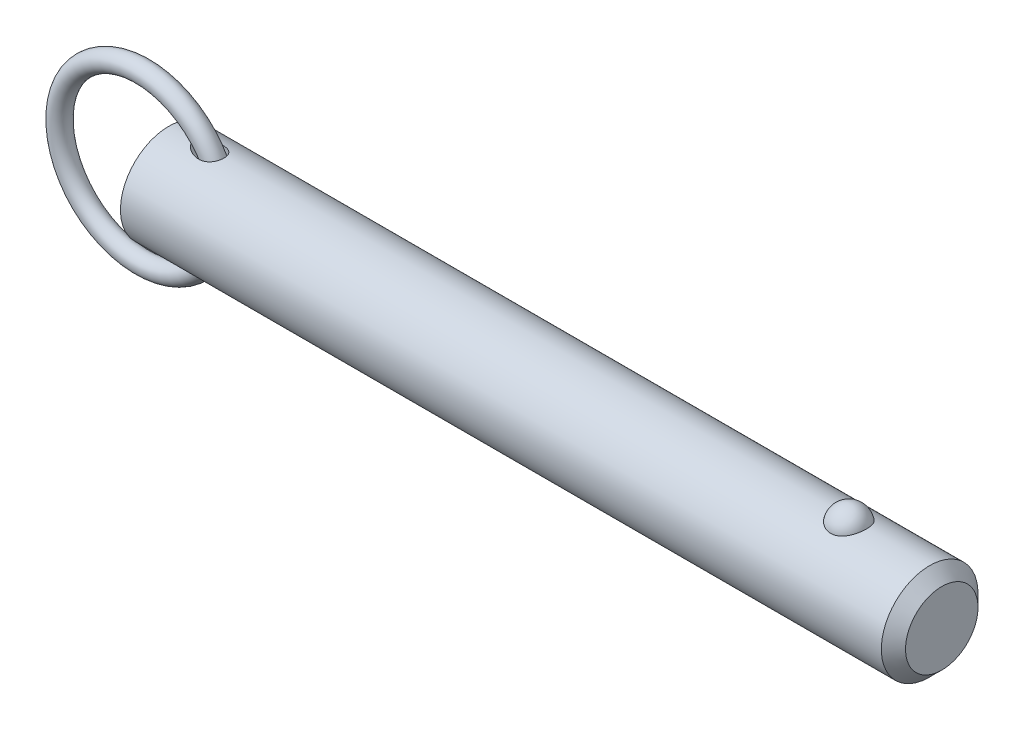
ISO-10303-21;
HEADER;
FILE_DESCRIPTION(('STEP AP214'),'2;1');
FILE_NAME('part.step','',(''),(''),'','','');
FILE_SCHEMA(('AUTOMOTIVE_DESIGN { 1 0 10303 214 1 1 1 1 }'));
ENDSEC;
DATA;
#1=APPLICATION_CONTEXT('core data for automotive mechanical design processes');
#2=APPLICATION_PROTOCOL_DEFINITION('international standard','automotive_design',2000,#1);
#3=PRODUCT_CONTEXT('',#1,'mechanical');
#4=PRODUCT('Part','Part','',(#3));
#5=PRODUCT_RELATED_PRODUCT_CATEGORY('part','',(#4));
#6=PRODUCT_DEFINITION_FORMATION('','',#4);
#7=PRODUCT_DEFINITION_CONTEXT('part definition',#1,'design');
#8=PRODUCT_DEFINITION('design','',#6,#7);
#9=PRODUCT_DEFINITION_SHAPE('','',#8);
#10=(LENGTH_UNIT() NAMED_UNIT(*) SI_UNIT(.MILLI.,.METRE.));
#11=(NAMED_UNIT(*) PLANE_ANGLE_UNIT() SI_UNIT($,.RADIAN.));
#12=(NAMED_UNIT(*) SI_UNIT($,.STERADIAN.) SOLID_ANGLE_UNIT());
#13=UNCERTAINTY_MEASURE_WITH_UNIT(LENGTH_MEASURE(1.E-05),#10,'distance_accuracy_value','');
#14=(GEOMETRIC_REPRESENTATION_CONTEXT(3) GLOBAL_UNCERTAINTY_ASSIGNED_CONTEXT((#13)) GLOBAL_UNIT_ASSIGNED_CONTEXT((#10,
#11,#12)) REPRESENTATION_CONTEXT('',''));
#15=CARTESIAN_POINT('',(0.,0.,0.));
#16=DIRECTION('',(0.,0.,1.));
#17=DIRECTION('',(1.,0.,0.));
#18=AXIS2_PLACEMENT_3D('',#15,#16,#17);
#19=CARTESIAN_POINT('',(-6.08699288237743,0.,0.));
#20=DIRECTION('',(0.,0.,1.));
#21=DIRECTION('',(1.,0.,0.));
#22=AXIS2_PLACEMENT_3D('',#19,#20,#21);
#23=TOROIDAL_SURFACE('',#22,19.05,2.223);
#24=CARTESIAN_POINT('',(15.1860071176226,0.,0.));
#25=VERTEX_POINT('',#24);
#26=VERTEX_LOOP('',#25);
#27=FACE_BOUND('',#26,.T.);
#28=ADVANCED_FACE('P0_F12',(#27),#23,.T.);
#29=CLOSED_SHELL('',(#28));
#30=MANIFOLD_SOLID_BREP('P0_B1',#29);
#31=CARTESIAN_POINT('',(0.,0.,0.));
#32=DIRECTION('',(1.,0.,0.));
#33=DIRECTION('',(0.,0.,-1.));
#34=AXIS2_PLACEMENT_3D('',#31,#32,#33);
#35=CYLINDRICAL_SURFACE('',#34,11.115);
#36=CARTESIAN_POINT('',(6.41405181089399,11.0227946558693,-1.4287136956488));
#37=CARTESIAN_POINT('',(6.49338916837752,11.0115377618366,-1.51556642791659));
#38=CARTESIAN_POINT('',(6.57765461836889,10.9998263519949,-1.59789397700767));
#39=CARTESIAN_POINT('',(6.75386647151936,10.9760304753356,-1.75391400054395));
#40=CARTESIAN_POINT('',(6.84582247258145,10.9639455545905,-1.82759540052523));
#41=CARTESIAN_POINT('',(7.03627827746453,10.9397989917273,-1.96698954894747));
#42=CARTESIAN_POINT('',(7.1348083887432,10.9277377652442,-2.03266078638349));
#43=CARTESIAN_POINT('',(7.33681032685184,10.9041015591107,-2.1558582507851));
#44=CARTESIAN_POINT('',(7.44028007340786,10.8925263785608,-2.21338786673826));
#45=CARTESIAN_POINT('',(7.64386117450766,10.8710104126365,-2.31666528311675));
#46=CARTESIAN_POINT('',(7.74368989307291,10.8610119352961,-2.36295942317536));
#47=CARTESIAN_POINT('',(7.94637195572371,10.8420168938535,-2.44863486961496));
#48=CARTESIAN_POINT('',(8.0492261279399,10.8330206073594,-2.48801426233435));
#49=CARTESIAN_POINT('',(8.36115573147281,10.807980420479,-2.59542730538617));
#50=CARTESIAN_POINT('',(8.57411849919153,10.7938278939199,-2.65299817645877));
#51=CARTESIAN_POINT('',(9.00825016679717,10.7725818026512,-2.73800108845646));
#52=CARTESIAN_POINT('',(9.22947335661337,10.7655491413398,-2.76517330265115));
#53=CARTESIAN_POINT('',(9.6736814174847,10.7605872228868,-2.78445308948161));
#54=CARTESIAN_POINT('',(9.89666486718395,10.7626512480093,-2.77658653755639));
#55=CARTESIAN_POINT('',(10.2950172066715,10.7754452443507,-2.72644436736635));
#56=CARTESIAN_POINT('',(10.4712789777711,10.7844280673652,-2.69109376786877));
#57=CARTESIAN_POINT('',(10.7292776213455,10.8024982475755,-2.61722365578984));
#58=CARTESIAN_POINT('',(10.8142337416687,10.8092901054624,-2.58911576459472));
#59=CARTESIAN_POINT('',(10.9813218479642,10.8242580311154,-2.52581287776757));
#60=CARTESIAN_POINT('',(11.0634550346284,10.8324335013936,-2.49062094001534));
#61=CARTESIAN_POINT('',(11.2247418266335,10.8500287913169,-2.41281958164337));
#62=CARTESIAN_POINT('',(11.3038694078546,10.8594572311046,-2.37015806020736));
#63=CARTESIAN_POINT('',(11.4576781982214,10.8792243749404,-2.27770403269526));
#64=CARTESIAN_POINT('',(11.5323615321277,10.8895626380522,-2.22791497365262));
#65=CARTESIAN_POINT('',(11.6765388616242,10.9108113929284,-2.12140590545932));
#66=CARTESIAN_POINT('',(11.7460329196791,10.9217218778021,-2.064685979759));
#67=CARTESIAN_POINT('',(11.8790597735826,10.9437207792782,-1.94471764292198));
#68=CARTESIAN_POINT('',(11.9425932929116,10.9548091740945,-1.88147002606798));
#69=CARTESIAN_POINT('',(12.109388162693,10.9851999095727,-1.69784918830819));
#70=CARTESIAN_POINT('',(12.205655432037,11.0042655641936,-1.57093023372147));
#71=CARTESIAN_POINT('',(12.374151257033,11.0393391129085,-1.3017676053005));
#72=CARTESIAN_POINT('',(12.4463875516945,11.0553479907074,-1.15952888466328));
#73=CARTESIAN_POINT('',(12.5615818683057,11.0816338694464,-0.871972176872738));
#74=CARTESIAN_POINT('',(12.6058896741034,11.0921698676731,-0.727217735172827));
#75=CARTESIAN_POINT('',(12.6699315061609,11.1075802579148,-0.43208997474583));
#76=CARTESIAN_POINT('',(12.6896681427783,11.1124552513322,-0.281717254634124));
#77=CARTESIAN_POINT('',(12.704022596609,11.1159901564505,0.0188164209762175));
#78=CARTESIAN_POINT('',(12.6988836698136,11.1147102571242,0.16896512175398));
#79=CARTESIAN_POINT('',(12.6641681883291,11.1062126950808,0.466238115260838));
#80=CARTESIAN_POINT('',(12.6345920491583,11.0989951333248,0.613362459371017));
#81=CARTESIAN_POINT('',(12.5517453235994,11.0794095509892,0.900330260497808));
#82=CARTESIAN_POINT('',(12.4984878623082,11.0670443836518,1.04017770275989));
#83=CARTESIAN_POINT('',(12.3696588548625,11.0385082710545,1.308745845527));
#84=CARTESIAN_POINT('',(12.2940887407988,11.0223375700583,1.43746725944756));
#85=CARTESIAN_POINT('',(12.122380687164,10.987872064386,1.68079704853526));
#86=CARTESIAN_POINT('',(12.0261637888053,10.969569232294,1.79534850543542));
#87=CARTESIAN_POINT('',(11.8161707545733,10.932836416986,2.00695695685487));
#88=CARTESIAN_POINT('',(11.7023941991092,10.9144064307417,2.10401353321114));
#89=CARTESIAN_POINT('',(11.4575656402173,10.8788057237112,2.28105326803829));
#90=CARTESIAN_POINT('',(11.3261451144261,10.8616794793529,2.36053412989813));
#91=CARTESIAN_POINT('',(11.0523589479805,10.8308019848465,2.49839044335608));
#92=CARTESIAN_POINT('',(10.9099908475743,10.8170514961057,2.55676113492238));
#93=CARTESIAN_POINT('',(10.6060622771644,10.7929728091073,2.65666105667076));
#94=CARTESIAN_POINT('',(10.4438877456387,10.7830209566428,2.69640163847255));
#95=CARTESIAN_POINT('',(10.1154037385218,10.7687230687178,2.75293129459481));
#96=CARTESIAN_POINT('',(9.94909141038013,10.7643810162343,2.76970406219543));
#97=CARTESIAN_POINT('',(9.54387061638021,10.7604809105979,2.7848723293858));
#98=CARTESIAN_POINT('',(9.30446860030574,10.7637793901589,2.7722775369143));
#99=CARTESIAN_POINT('',(8.94961255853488,10.7757341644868,2.72524141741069));
#100=CARTESIAN_POINT('',(8.83186896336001,10.7808994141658,2.70482239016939));
#101=CARTESIAN_POINT('',(8.59835142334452,10.7932548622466,2.65509992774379));
#102=CARTESIAN_POINT('',(8.48257728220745,10.8004448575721,2.62579738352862));
#103=CARTESIAN_POINT('',(8.25208469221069,10.8166382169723,2.55827624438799));
#104=CARTESIAN_POINT('',(8.13740214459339,10.8256649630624,2.51994155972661));
#105=CARTESIAN_POINT('',(7.91132058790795,10.8451170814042,2.43486475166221));
#106=CARTESIAN_POINT('',(7.79992154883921,10.8555424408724,2.38812270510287));
#107=CARTESIAN_POINT('',(7.58115677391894,10.8774251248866,2.28638483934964));
#108=CARTESIAN_POINT('',(7.47378802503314,10.8888816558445,2.23139534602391));
#109=CARTESIAN_POINT('',(7.26385624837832,10.9124540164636,2.11310265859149));
#110=CARTESIAN_POINT('',(7.16129168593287,10.9245696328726,2.04980214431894));
#111=CARTESIAN_POINT('',(6.91882218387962,10.9543689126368,1.88540538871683));
#112=CARTESIAN_POINT('',(6.7819377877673,10.9721958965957,1.77979827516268));
#113=CARTESIAN_POINT('',(6.52472441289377,11.0070222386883,1.5498969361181));
#114=CARTESIAN_POINT('',(6.40436902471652,11.0240228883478,1.42563320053));
#115=CARTESIAN_POINT('',(6.2183880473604,11.0509658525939,1.19529359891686));
#116=CARTESIAN_POINT('',(6.14691885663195,11.0615430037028,1.09404520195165));
#117=CARTESIAN_POINT('',(6.02043496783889,11.0805004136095,0.881508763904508));
#118=CARTESIAN_POINT('',(5.96539400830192,11.0888841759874,0.7702371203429));
#119=CARTESIAN_POINT('',(5.88475453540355,11.1012553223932,0.560577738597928));
#120=CARTESIAN_POINT('',(5.85559643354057,11.1057686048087,0.463603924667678));
#121=CARTESIAN_POINT('',(5.81381299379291,11.1122523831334,0.266083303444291));
#122=CARTESIAN_POINT('',(5.80117118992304,11.1142254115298,0.165540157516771));
#123=CARTESIAN_POINT('',(5.79363815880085,11.1153999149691,-0.0364747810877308));
#124=CARTESIAN_POINT('',(5.79878799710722,11.1145949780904,-0.137948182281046));
#125=CARTESIAN_POINT('',(5.82639592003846,11.1102987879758,-0.338493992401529));
#126=CARTESIAN_POINT('',(5.8488723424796,11.1068046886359,-0.437563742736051));
#127=CARTESIAN_POINT('',(5.91510741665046,11.0965857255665,-0.649968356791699));
#128=CARTESIAN_POINT('',(5.96220905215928,11.0893566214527,-0.762222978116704));
#129=CARTESIAN_POINT('',(6.07378449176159,11.072471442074,-0.977396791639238));
#130=CARTESIAN_POINT('',(6.13826787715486,11.0628140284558,-1.08031079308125));
#131=CARTESIAN_POINT('',(6.24101077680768,11.0477136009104,-1.2219580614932));
#132=CARTESIAN_POINT('',(6.27403486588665,11.042895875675,-1.26469183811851));
#133=CARTESIAN_POINT('',(6.3423802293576,11.0330152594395,-1.34817011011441));
#134=CARTESIAN_POINT('',(6.37769867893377,11.0279526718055,-1.38891694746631));
#135=CARTESIAN_POINT('',(6.41405181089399,11.0227946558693,-1.4287136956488));
#136=B_SPLINE_CURVE_WITH_KNOTS('',3,(#36,#37,#38,#39,#40,#41,#42,#43,#44,#45,#46,#47,#48,#49,
#50,#51,#52,#53,#54,#55,#56,#57,#58,#59,#60,#61,#62,#63,#64,#65,#66,#67,#68,#69,#70,#71,#72,#73,
#74,#75,#76,#77,#78,#79,#80,#81,#82,#83,#84,#85,#86,#87,#88,#89,#90,#91,#92,#93,#94,#95,#96,#97,
#98,#99,#100,#101,#102,#103,#104,#105,#106,#107,#108,#109,#110,#111,#112,#113,#114,#115,#116,
#117,#118,#119,#120,#121,#122,#123,#124,#125,#126,#127,#128,#129,#130,#131,#132,#133,#134,#135),
.UNSPECIFIED.,.T.,.F.,(4,2,2,2,2,2,2,2,2,2,2,2,2,2,2,2,2,2,2,2,2,2,2,2,2,2,2,2,2,2,2,2,2,2,2,2,
2,2,2,2,2,2,2,2,2,2,2,2,2,4),(0.,0.354433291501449,0.709315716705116,1.0659654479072,
1.42246628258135,1.7536715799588,2.08496839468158,2.74582009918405,3.41227815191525,
4.07824412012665,4.61583787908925,4.88478112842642,5.1536085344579,5.42439170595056,
5.69504436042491,5.96569375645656,6.23631025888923,6.7149072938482,7.1933500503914,
7.6464143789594,8.09943057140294,8.54802575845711,8.99661331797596,9.44495256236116,
9.89326303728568,10.3433195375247,10.7933867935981,11.2550086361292,11.7167345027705,
12.2165866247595,12.7167934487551,13.4318876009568,13.7904664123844,14.1490092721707,
14.5124394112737,14.8758662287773,15.239015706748,15.6020483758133,16.1219860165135,
16.6410830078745,17.0130520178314,17.3844231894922,17.6872330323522,17.9897407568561,
18.2929471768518,18.5964749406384,18.9603532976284,19.3244326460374,19.4870338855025,
19.649438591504),.UNSPECIFIED.);
#137=CARTESIAN_POINT('',(6.41405181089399,11.0227946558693,-1.4287136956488));
#138=VERTEX_POINT('',#137);
#139=EDGE_CURVE('P1_E40',#138,#138,#136,.T.);
#140=ORIENTED_EDGE('',*,*,#139,.T.);
#141=EDGE_LOOP('',(#140));
#142=FACE_BOUND('',#141,.T.);
#143=CARTESIAN_POINT('',(175.02125,0.,0.));
#144=DIRECTION('',(1.,0.,0.));
#145=DIRECTION('',(0.,0.,-1.));
#146=AXIS2_PLACEMENT_3D('',#143,#144,#145);
#147=CIRCLE('',#146,11.115);
#148=CARTESIAN_POINT('',(175.02125,0.,-11.115));
#149=VERTEX_POINT('',#148);
#150=EDGE_CURVE('P1_E25',#149,#149,#147,.T.);
#151=ORIENTED_EDGE('',*,*,#150,.F.);
#152=EDGE_LOOP('',(#151));
#153=FACE_BOUND('',#152,.T.);
#154=CARTESIAN_POINT('',(0.,0.,0.));
#155=DIRECTION('',(1.,0.,0.));
#156=DIRECTION('',(0.,0.,-1.));
#157=AXIS2_PLACEMENT_3D('',#154,#155,#156);
#158=CIRCLE('',#157,11.115);
#159=CARTESIAN_POINT('',(0.,0.,-11.115));
#160=VERTEX_POINT('',#159);
#161=EDGE_CURVE('P1_E9',#160,#160,#158,.T.);
#162=ORIENTED_EDGE('',*,*,#161,.T.);
#163=EDGE_LOOP('',(#162));
#164=FACE_BOUND('',#163,.T.);
#165=CARTESIAN_POINT('',(156.431068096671,10.3028087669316,4.17077409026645));
#166=CARTESIAN_POINT('',(156.214775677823,10.3028003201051,4.17078240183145));
#167=CARTESIAN_POINT('',(155.998548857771,10.3098895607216,4.15340593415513));
#168=CARTESIAN_POINT('',(155.572540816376,10.3373834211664,4.08449540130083));
#169=CARTESIAN_POINT('',(155.362757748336,10.3577841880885,4.0329712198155));
#170=CARTESIAN_POINT('',(154.955782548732,10.4095237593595,3.89746513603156));
#171=CARTESIAN_POINT('',(154.758572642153,10.4408466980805,3.81353029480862));
#172=CARTESIAN_POINT('',(154.381338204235,10.5110236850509,3.61560339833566));
#173=CARTESIAN_POINT('',(154.201317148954,10.5498792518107,3.50160528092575));
#174=CARTESIAN_POINT('',(153.857684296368,10.6322884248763,3.24292464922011));
#175=CARTESIAN_POINT('',(153.694686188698,10.6759443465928,3.09746040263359));
#176=CARTESIAN_POINT('',(153.394591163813,10.7625291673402,2.7817192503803));
#177=CARTESIAN_POINT('',(153.257499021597,10.8054579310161,2.61143778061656));
#178=CARTESIAN_POINT('',(153.006408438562,10.8881935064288,2.24226695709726));
#179=CARTESIAN_POINT('',(152.893710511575,10.9277761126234,2.04244123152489));
#180=CARTESIAN_POINT('',(152.701777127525,10.997484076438,1.62578254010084));
#181=CARTESIAN_POINT('',(152.622544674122,11.0276085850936,1.40894804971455));
#182=CARTESIAN_POINT('',(152.498303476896,11.0756732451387,0.961250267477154));
#183=CARTESIAN_POINT('',(152.453760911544,11.0934470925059,0.730239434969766));
#184=CARTESIAN_POINT('',(152.401569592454,11.1143331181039,0.263439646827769));
#185=CARTESIAN_POINT('',(152.393920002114,11.1174456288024,0.0276507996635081));
#186=CARTESIAN_POINT('',(152.41561056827,11.1087161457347,-0.440729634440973));
#187=CARTESIAN_POINT('',(152.444762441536,11.0969502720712,-0.6733313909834));
#188=CARTESIAN_POINT('',(152.539143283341,11.0597872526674,-1.12996621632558));
#189=CARTESIAN_POINT('',(152.604372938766,11.0343898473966,-1.35399912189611));
#190=CARTESIAN_POINT('',(152.76969844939,10.972515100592,-1.78750286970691));
#191=CARTESIAN_POINT('',(152.86983863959,10.9360236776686,-1.99695478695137));
#192=CARTESIAN_POINT('',(153.102940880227,10.8557595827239,-2.39520667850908));
#193=CARTESIAN_POINT('',(153.235905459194,10.8119863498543,-2.58400506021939));
#194=CARTESIAN_POINT('',(153.532407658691,10.7216733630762,-2.93635726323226));
#195=CARTESIAN_POINT('',(153.696056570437,10.675123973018,-3.09981510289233));
#196=CARTESIAN_POINT('',(154.049860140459,10.5846571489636,-3.39592247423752));
#197=CARTESIAN_POINT('',(154.240012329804,10.5407394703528,-3.52857487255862));
#198=CARTESIAN_POINT('',(154.63750141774,10.4616690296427,-3.75646057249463));
#199=CARTESIAN_POINT('',(154.84436705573,10.4263443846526,-3.85245432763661));
#200=CARTESIAN_POINT('',(155.272954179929,10.3675574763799,-4.00798747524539));
#201=CARTESIAN_POINT('',(155.494670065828,10.344090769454,-4.0675405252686));
#202=CARTESIAN_POINT('',(155.934669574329,10.3128282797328,-4.14614314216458));
#203=CARTESIAN_POINT('',(156.152565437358,10.3043040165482,-4.1670783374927));
#204=CARTESIAN_POINT('',(156.58894951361,10.3016771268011,-4.17357158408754));
#205=CARTESIAN_POINT('',(156.807437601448,10.3075716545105,-4.15913661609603));
#206=CARTESIAN_POINT('',(157.231744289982,10.3326686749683,-4.09636961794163));
#207=CARTESIAN_POINT('',(157.437745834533,10.3514555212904,-4.0490957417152));
#208=CARTESIAN_POINT('',(157.838576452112,10.399818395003,-3.92320197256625));
#209=CARTESIAN_POINT('',(158.0334046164,10.4293952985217,-3.84457953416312));
#210=CARTESIAN_POINT('',(158.411191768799,10.4969600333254,-3.65612410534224));
#211=CARTESIAN_POINT('',(158.593797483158,10.5351178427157,-3.54564545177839));
#212=CARTESIAN_POINT('',(158.938204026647,10.6154999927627,-3.29718036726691));
#213=CARTESIAN_POINT('',(159.100000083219,10.657725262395,-3.15918764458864));
#214=CARTESIAN_POINT('',(159.406959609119,10.744212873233,-2.85163580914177));
#215=CARTESIAN_POINT('',(159.550891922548,10.7884718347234,-2.68084605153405));
#216=CARTESIAN_POINT('',(159.809237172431,10.872374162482,-2.31721864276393));
#217=CARTESIAN_POINT('',(159.923644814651,10.9120167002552,-2.12437704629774));
#218=CARTESIAN_POINT('',(160.123873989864,10.9838919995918,-1.71516999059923));
#219=CARTESIAN_POINT('',(160.20866178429,11.0158465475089,-1.49824866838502));
#220=CARTESIAN_POINT('',(160.34268382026,11.0673523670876,-1.05228572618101));
#221=CARTESIAN_POINT('',(160.391917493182,11.086903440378,-0.823243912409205));
#222=CARTESIAN_POINT('',(160.453891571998,11.1116323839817,-0.359087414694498));
#223=CARTESIAN_POINT('',(160.466566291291,11.1167843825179,-0.123962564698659));
#224=CARTESIAN_POINT('',(160.454973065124,11.1121144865,0.345220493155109));
#225=CARTESIAN_POINT('',(160.430705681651,11.1022928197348,0.579278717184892));
#226=CARTESIAN_POINT('',(160.345907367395,11.0687504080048,1.03866534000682));
#227=CARTESIAN_POINT('',(160.285529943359,11.0450885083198,1.26402641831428));
#228=CARTESIAN_POINT('',(160.129853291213,10.9863185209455,1.70076772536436));
#229=CARTESIAN_POINT('',(160.034551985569,10.9512097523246,1.91214712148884));
#230=CARTESIAN_POINT('',(159.810397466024,10.8729733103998,2.316083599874));
#231=CARTESIAN_POINT('',(159.681380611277,10.8298068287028,2.50854240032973));
#232=CARTESIAN_POINT('',(159.392732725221,10.7401896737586,2.86808766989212));
#233=CARTESIAN_POINT('',(159.233102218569,10.6937390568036,3.03517457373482));
#234=CARTESIAN_POINT('',(158.887534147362,10.6029321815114,3.33857581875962));
#235=CARTESIAN_POINT('',(158.701708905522,10.5585680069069,3.47501541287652));
#236=CARTESIAN_POINT('',(158.307875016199,10.4769321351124,3.71390897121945));
#237=CARTESIAN_POINT('',(158.099863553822,10.439661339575,3.81635861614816));
#238=CARTESIAN_POINT('',(157.654066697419,10.3749407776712,3.98910631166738));
#239=CARTESIAN_POINT('',(157.415234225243,10.3482457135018,4.05700929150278));
#240=CARTESIAN_POINT('',(156.927925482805,10.312188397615,4.14782844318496));
#241=CARTESIAN_POINT('',(156.679453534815,10.3028184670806,4.17076454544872));
#242=CARTESIAN_POINT('',(156.431068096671,10.3028087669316,4.17077409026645));
#243=B_SPLINE_CURVE_WITH_KNOTS('',3,(#165,#166,#167,#168,#169,#170,#171,#172,#173,#174,#175,
#176,#177,#178,#179,#180,#181,#182,#183,#184,#185,#186,#187,#188,#189,#190,#191,#192,#193,#194,
#195,#196,#197,#198,#199,#200,#201,#202,#203,#204,#205,#206,#207,#208,#209,#210,#211,#212,#213,
#214,#215,#216,#217,#218,#219,#220,#221,#222,#223,#224,#225,#226,#227,#228,#229,#230,#231,#232,
#233,#234,#235,#236,#237,#238,#239,#240,#241,#242),.UNSPECIFIED.,.T.,.F.,(4,2,2,2,2,2,2,2,2,2,2,
2,2,2,2,2,2,2,2,2,2,2,2,2,2,2,2,2,2,2,2,2,2,2,2,2,2,2,4),(0.,0.64796614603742,1.29574482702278,
1.9425864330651,2.58955857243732,3.25496465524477,3.92049326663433,4.61566368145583,
5.31089647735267,6.01531821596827,6.71972398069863,7.42054043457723,8.12137023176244,
8.82309331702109,9.52487047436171,10.2292439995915,10.9335519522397,11.6223330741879,
12.3108558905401,12.9647664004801,13.6185478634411,14.252184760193,14.8858731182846,
15.5334360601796,16.1811472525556,16.8611459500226,17.5412664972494,18.2431855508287,
18.9451158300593,19.6483065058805,20.3514864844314,21.0516982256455,21.7519516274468,
22.4556690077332,23.1593743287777,23.860149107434,24.5610129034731,25.3054529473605,
26.049562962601),.UNSPECIFIED.);
#244=CARTESIAN_POINT('',(156.431068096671,10.3028087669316,4.17077409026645));
#245=VERTEX_POINT('',#244);
#246=EDGE_CURVE('P1_E34',#245,#245,#243,.T.);
#247=ORIENTED_EDGE('',*,*,#246,.T.);
#248=EDGE_LOOP('',(#247));
#249=FACE_BOUND('',#248,.T.);
#250=CARTESIAN_POINT('',(6.41405181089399,-11.0227946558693,-1.4287136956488));
#251=CARTESIAN_POINT('',(6.33124061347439,-11.0345445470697,-1.33806125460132));
#252=CARTESIAN_POINT('',(6.25372866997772,-11.0458090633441,-1.24240732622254));
#253=CARTESIAN_POINT('',(6.11277905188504,-11.0666115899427,-1.04095704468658));
#254=CARTESIAN_POINT('',(6.04933920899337,-11.0761498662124,-0.935162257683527));
#255=CARTESIAN_POINT('',(5.94029181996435,-11.0927063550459,-0.712476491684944));
#256=CARTESIAN_POINT('',(5.89492964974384,-11.0996897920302,-0.595457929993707));
#257=CARTESIAN_POINT('',(5.84498161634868,-11.1074141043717,-0.414997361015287));
#258=CARTESIAN_POINT('',(5.83135004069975,-11.1095300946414,-0.354047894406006));
#259=CARTESIAN_POINT('',(5.81051649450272,-11.1127688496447,-0.231041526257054));
#260=CARTESIAN_POINT('',(5.80331311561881,-11.1138918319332,-0.168984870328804));
#261=CARTESIAN_POINT('',(5.79296529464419,-11.1155042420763,-0.000484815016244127));
#262=CARTESIAN_POINT('',(5.79625267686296,-11.1149904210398,0.106437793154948));
#263=CARTESIAN_POINT('',(5.82213676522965,-11.1109609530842,0.317809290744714));
#264=CARTESIAN_POINT('',(5.84474662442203,-11.1074432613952,0.42225644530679));
#265=CARTESIAN_POINT('',(5.911131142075,-11.097197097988,0.639361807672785));
#266=CARTESIAN_POINT('',(5.95733120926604,-11.090102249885,0.751250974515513));
#267=CARTESIAN_POINT('',(6.06709542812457,-11.0734770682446,0.965912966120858));
#268=CARTESIAN_POINT('',(6.13068735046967,-11.06394284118,1.06867085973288));
#269=CARTESIAN_POINT('',(6.30294237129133,-11.0385920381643,1.30890635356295));
#270=CARTESIAN_POINT('',(6.41896200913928,-11.0218881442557,1.44097376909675));
#271=CARTESIAN_POINT('',(6.6698965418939,-10.9871512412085,1.68553954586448));
#272=CARTESIAN_POINT('',(6.80485520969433,-10.9691152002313,1.79799117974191));
#273=CARTESIAN_POINT('',(7.04881236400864,-10.9382283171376,1.97587596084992));
#274=CARTESIAN_POINT('',(7.15465712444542,-10.9253240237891,2.04570822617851));
#275=CARTESIAN_POINT('',(7.37202504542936,-10.9000987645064,2.17611840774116));
#276=CARTESIAN_POINT('',(7.48355057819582,-10.8877780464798,2.23669241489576));
#277=CARTESIAN_POINT('',(7.71132418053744,-10.8641580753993,2.34873831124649));
#278=CARTESIAN_POINT('',(7.82757727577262,-10.8528599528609,2.40020018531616));
#279=CARTESIAN_POINT('',(8.06386825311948,-10.8317234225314,2.49385169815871));
#280=CARTESIAN_POINT('',(8.18390558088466,-10.8218848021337,2.53604268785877));
#281=CARTESIAN_POINT('',(8.42918336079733,-10.8039208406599,2.61152283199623));
#282=CARTESIAN_POINT('',(8.55447802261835,-10.7958283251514,2.64464414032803));
#283=CARTESIAN_POINT('',(8.80752127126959,-10.781995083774,2.70048793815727));
#284=CARTESIAN_POINT('',(8.93527019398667,-10.7762546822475,2.72320899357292));
#285=CARTESIAN_POINT('',(9.1921017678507,-10.7675291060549,2.75750994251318));
#286=CARTESIAN_POINT('',(9.32118105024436,-10.7645381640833,2.76911315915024));
#287=CARTESIAN_POINT('',(9.57984338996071,-10.761622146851,2.78042035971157));
#288=CARTESIAN_POINT('',(9.70942621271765,-10.7616957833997,2.78012934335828));
#289=CARTESIAN_POINT('',(10.0243125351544,-10.7659059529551,2.76381534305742));
#290=CARTESIAN_POINT('',(10.209307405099,-10.7717977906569,2.74099674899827));
#291=CARTESIAN_POINT('',(10.5731188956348,-10.7905408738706,2.66626238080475));
#292=CARTESIAN_POINT('',(10.7519389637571,-10.8033881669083,2.61436313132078));
#293=CARTESIAN_POINT('',(11.0114289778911,-10.8271584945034,2.51336808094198));
#294=CARTESIAN_POINT('',(11.096831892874,-10.835881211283,2.47562331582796));
#295=CARTESIAN_POINT('',(11.2636000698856,-10.8545688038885,2.39236170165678));
#296=CARTESIAN_POINT('',(11.3449673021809,-10.8645330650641,2.3468486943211));
#297=CARTESIAN_POINT('',(11.5027832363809,-10.8853818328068,2.24815967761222));
#298=CARTESIAN_POINT('',(11.5792327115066,-10.8962661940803,2.19498487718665));
#299=CARTESIAN_POINT('',(11.7263315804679,-10.9185541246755,2.08128855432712));
#300=CARTESIAN_POINT('',(11.7969818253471,-10.9299576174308,2.02076811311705));
#301=CARTESIAN_POINT('',(11.9817953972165,-10.9613645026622,1.84513663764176));
#302=CARTESIAN_POINT('',(12.0893012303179,-10.9814643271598,1.72286660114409));
#303=CARTESIAN_POINT('',(12.2803576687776,-11.0193991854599,1.46066991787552));
#304=CARTESIAN_POINT('',(12.3639173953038,-11.0372350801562,1.3207500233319));
#305=CARTESIAN_POINT('',(12.4996220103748,-11.0672969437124,1.03778067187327));
#306=CARTESIAN_POINT('',(12.5535315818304,-11.0798242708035,0.895607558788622));
#307=CARTESIAN_POINT('',(12.636874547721,-11.0995427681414,0.603918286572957));
#308=CARTESIAN_POINT('',(12.6663115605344,-11.1067347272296,0.454403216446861));
#309=CARTESIAN_POINT('',(12.6997387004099,-11.1149224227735,0.154577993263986));
#310=CARTESIAN_POINT('',(12.7040886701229,-11.1160057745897,0.00431019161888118));
#311=CARTESIAN_POINT('',(12.6882048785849,-11.1120956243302,-0.294841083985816));
#312=CARTESIAN_POINT('',(12.6679715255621,-11.1071022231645,-0.443724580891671));
#313=CARTESIAN_POINT('',(12.6034470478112,-11.0915888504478,-0.735688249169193));
#314=CARTESIAN_POINT('',(12.5591858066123,-11.0810757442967,-0.878775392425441));
#315=CARTESIAN_POINT('',(12.4477416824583,-11.0556687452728,-1.15529525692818));
#316=CARTESIAN_POINT('',(12.3805601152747,-11.0407751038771,-1.28872853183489));
#317=CARTESIAN_POINT('',(12.2248919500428,-11.0081839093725,-1.54257976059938));
#318=CARTESIAN_POINT('',(12.1363549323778,-10.9904797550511,-1.66296592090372));
#319=CARTESIAN_POINT('',(11.9406137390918,-10.9541951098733,-1.88726577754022));
#320=CARTESIAN_POINT('',(11.833409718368,-10.9356146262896,-1.9911796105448));
#321=CARTESIAN_POINT('',(11.601318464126,-10.8991360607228,-2.18213646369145));
#322=CARTESIAN_POINT('',(11.4761325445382,-10.8812577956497,-2.26881927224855));
#323=CARTESIAN_POINT('',(11.2134852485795,-10.8482871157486,-2.42157282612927));
#324=CARTESIAN_POINT('',(11.0760218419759,-10.8331951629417,-2.48764015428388));
#325=CARTESIAN_POINT('',(10.7828968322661,-10.8061050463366,-2.60290068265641));
#326=CARTESIAN_POINT('',(10.6266338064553,-10.7943907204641,-2.65062248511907));
#327=CARTESIAN_POINT('',(10.3086617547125,-10.7762429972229,-2.72345054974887));
#328=CARTESIAN_POINT('',(10.146948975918,-10.7698133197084,-2.74854088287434));
#329=CARTESIAN_POINT('',(9.75541304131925,-10.7608036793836,-2.78368719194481));
#330=CARTESIAN_POINT('',(9.52459435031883,-10.7608467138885,-2.78350276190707));
#331=CARTESIAN_POINT('',(9.0660496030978,-10.7702674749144,-2.74677945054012));
#332=CARTESIAN_POINT('',(8.83832966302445,-10.7796615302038,-2.71017697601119));
#333=CARTESIAN_POINT('',(8.38783466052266,-10.8058248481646,-2.60392490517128));
#334=CARTESIAN_POINT('',(8.16517101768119,-10.8226939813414,-2.53382676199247));
#335=CARTESIAN_POINT('',(7.84087311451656,-10.8516548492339,-2.40555545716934));
#336=CARTESIAN_POINT('',(7.73435551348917,-10.8619221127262,-2.35892455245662));
#337=CARTESIAN_POINT('',(7.52510420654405,-10.883357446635,-2.25797017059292));
#338=CARTESIAN_POINT('',(7.42236986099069,-10.8945253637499,-2.20364800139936));
#339=CARTESIAN_POINT('',(7.23808758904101,-10.915528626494,-2.09688018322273));
#340=CARTESIAN_POINT('',(7.15584631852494,-10.9252787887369,-2.0456107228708));
#341=CARTESIAN_POINT('',(6.99510576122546,-10.944960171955,-1.93754729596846));
#342=CARTESIAN_POINT('',(6.91660574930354,-10.9548913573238,-1.88075440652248));
#343=CARTESIAN_POINT('',(6.76418133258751,-10.974690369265,-1.76154504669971));
#344=CARTESIAN_POINT('',(6.69024940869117,-10.9845582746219,-1.6991382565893));
#345=CARTESIAN_POINT('',(6.54780119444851,-11.0039826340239,-1.56842485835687));
#346=CARTESIAN_POINT('',(6.47928247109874,-11.0135392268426,-1.50012092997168));
#347=CARTESIAN_POINT('',(6.41405181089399,-11.0227946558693,-1.4287136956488));
#348=B_SPLINE_CURVE_WITH_KNOTS('',3,(#250,#251,#252,#253,#254,#255,#256,#257,#258,#259,#260,
#261,#262,#263,#264,#265,#266,#267,#268,#269,#270,#271,#272,#273,#274,#275,#276,#277,#278,#279,
#280,#281,#282,#283,#284,#285,#286,#287,#288,#289,#290,#291,#292,#293,#294,#295,#296,#297,#298,
#299,#300,#301,#302,#303,#304,#305,#306,#307,#308,#309,#310,#311,#312,#313,#314,#315,#316,#317,
#318,#319,#320,#321,#322,#323,#324,#325,#326,#327,#328,#329,#330,#331,#332,#333,#334,#335,#336,
#337,#338,#339,#340,#341,#342,#343,#344,#345,#346,#347),.UNSPECIFIED.,.T.,.F.,(4,2,2,2,2,2,2,2,
2,2,2,2,2,2,2,2,2,2,2,2,2,2,2,2,2,2,2,2,2,2,2,2,2,2,2,2,2,2,2,2,2,2,2,2,2,2,2,2,4),(0.,
0.369835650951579,0.739614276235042,1.11425380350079,1.30141910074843,1.48854338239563,
1.80745879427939,2.12659146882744,2.48838884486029,2.85076733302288,3.3776216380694,
3.9057143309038,4.287639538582,4.66972556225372,5.05222896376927,5.43467659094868,
5.82378546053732,6.21294796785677,6.6012922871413,6.98947336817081,7.54669558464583,
8.10360148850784,8.38458539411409,8.66543074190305,8.94623182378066,9.22699162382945,
9.71628887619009,10.2053995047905,10.6608871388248,11.1163074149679,11.5651786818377,
12.0140424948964,12.4623493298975,12.9106304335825,13.3599804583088,13.8093267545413,
14.2672570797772,14.7252632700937,15.214740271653,15.7045615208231,16.3932594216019,
17.083162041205,17.7825738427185,18.1325177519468,18.4824022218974,18.7744056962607,
19.0663523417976,19.3578048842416,19.6491256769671),.UNSPECIFIED.);
#349=CARTESIAN_POINT('',(6.41405181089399,-11.0227946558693,-1.4287136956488));
#350=VERTEX_POINT('',#349);
#351=EDGE_CURVE('P1_E17',#350,#350,#348,.T.);
#352=ORIENTED_EDGE('',*,*,#351,.T.);
#353=EDGE_LOOP('',(#352));
#354=FACE_BOUND('',#353,.T.);
#355=ADVANCED_FACE('P1_F13',(#142,#153,#164,#249,#354),#35,.T.);
#356=CARTESIAN_POINT('',(0.,0.,0.));
#357=DIRECTION('',(-1.,0.,0.));
#358=DIRECTION('',(0.,0.,1.));
#359=AXIS2_PLACEMENT_3D('',#356,#357,#358);
#360=PLANE('',#359);
#361=ORIENTED_EDGE('',*,*,#161,.F.);
#362=EDGE_LOOP('',(#361));
#363=FACE_BOUND('',#362,.T.);
#364=ADVANCED_FACE('P1_F15',(#363),#360,.T.);
#365=CARTESIAN_POINT('',(177.8,0.,0.));
#366=DIRECTION('',(-1.,0.,0.));
#367=DIRECTION('',(0.,0.,1.));
#368=AXIS2_PLACEMENT_3D('',#365,#366,#367);
#369=CONICAL_SURFACE('',#368,8.33625000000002,0.78539816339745);
#370=ORIENTED_EDGE('',*,*,#150,.T.);
#371=EDGE_LOOP('',(#370));
#372=FACE_BOUND('',#371,.T.);
#373=CARTESIAN_POINT('',(177.8,0.,0.));
#374=DIRECTION('',(1.,0.,0.));
#375=DIRECTION('',(0.,0.,-1.));
#376=AXIS2_PLACEMENT_3D('',#373,#374,#375);
#377=CIRCLE('',#376,8.33625000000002);
#378=CARTESIAN_POINT('',(177.8,0.,-8.33625000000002));
#379=VERTEX_POINT('',#378);
#380=EDGE_CURVE('P1_E30',#379,#379,#377,.T.);
#381=ORIENTED_EDGE('',*,*,#380,.F.);
#382=EDGE_LOOP('',(#381));
#383=FACE_BOUND('',#382,.T.);
#384=ADVANCED_FACE('P1_F55',(#372,#383),#369,.T.);
#385=CARTESIAN_POINT('',(177.8,8.33625000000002,0.));
#386=DIRECTION('',(1.,0.,0.));
#387=DIRECTION('',(0.,0.,-1.));
#388=AXIS2_PLACEMENT_3D('',#385,#386,#387);
#389=PLANE('',#388);
#390=ORIENTED_EDGE('',*,*,#380,.T.);
#391=EDGE_LOOP('',(#390));
#392=FACE_BOUND('',#391,.T.);
#393=ADVANCED_FACE('P1_F51',(#392),#389,.T.);
#394=CARTESIAN_POINT('',(156.431068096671,10.0035,0.));
#395=DIRECTION('',(-1.,0.,0.));
#396=DIRECTION('',(0.,1.,0.));
#397=AXIS2_PLACEMENT_3D('',#394,#395,#396);
#398=SPHERICAL_SURFACE('',#397,4.18150000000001);
#399=ORIENTED_EDGE('',*,*,#246,.F.);
#400=EDGE_LOOP('',(#399));
#401=FACE_BOUND('',#400,.T.);
#402=ADVANCED_FACE('P1_F46',(#401),#398,.T.);
#403=CARTESIAN_POINT('',(-6.08699288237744,0.,0.));
#404=DIRECTION('',(0.,0.,1.));
#405=DIRECTION('',(1.,0.,0.));
#406=AXIS2_PLACEMENT_3D('',#403,#404,#405);
#407=TOROIDAL_SURFACE('',#406,19.05,2.77875);
#408=ORIENTED_EDGE('',*,*,#351,.F.);
#409=EDGE_LOOP('',(#408));
#410=FACE_BOUND('',#409,.T.);
#411=ORIENTED_EDGE('',*,*,#139,.F.);
#412=EDGE_LOOP('',(#411));
#413=FACE_BOUND('',#412,.T.);
#414=ADVANCED_FACE('P1_F50',(#410,#413),#407,.F.);
#415=CLOSED_SHELL('',(#355,#364,#384,#393,#402,#414));
#416=MANIFOLD_SOLID_BREP('P1_B1',#415);
#417=ADVANCED_BREP_SHAPE_REPRESENTATION('',(#18,#30,#416),#14);
#418=SHAPE_DEFINITION_REPRESENTATION(#9,#417);
ENDSEC;
END-ISO-10303-21;
